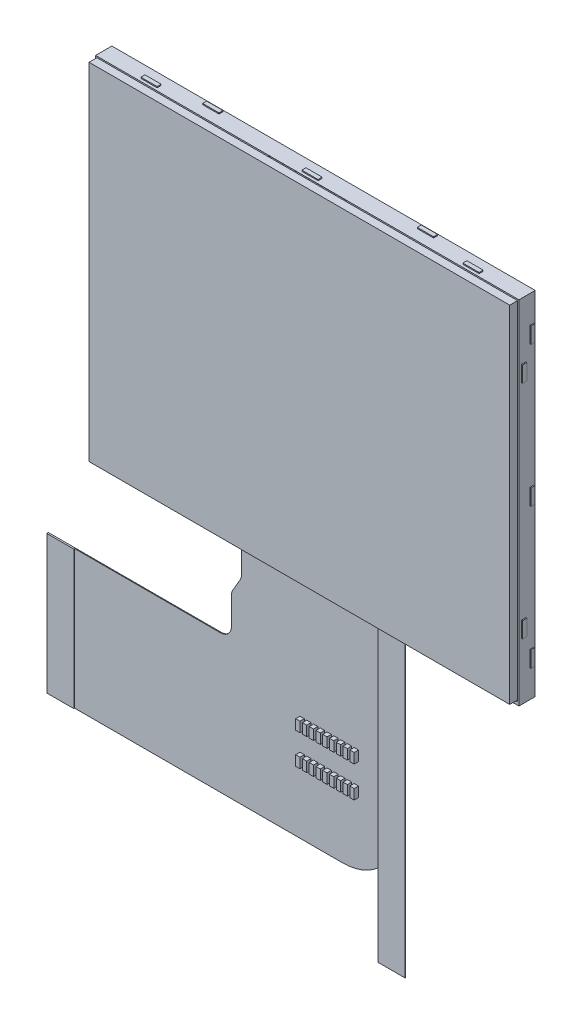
from build123d import *

# Parameters (mm, degrees)
SKETCH1_W             = 78.1
SKETCH1_H             = 64.9
SKETCH1_W_2           = 77.6
SKETCH1_H_2           = 63.8
SKETCH1_W_3           = 71.08
SKETCH1_H_3           = 53.56
SKETCH1_W_4           = 70.08
SKETCH1_H_4           = 52.56
MAIN_FRAME_DEPTH      = 3
SKETCH2_W             = 1.5
SKETCH2_H             = 15
CUT_EXTRUDE1_DEPTH    = 0.25
SKETCH3_W             = 28
SKETCH3_H             = 1.5
CUT_EXTRUDE2_DEPTH    = 0.55
SKETCH6_W             = 14.25
SKETCH6_H             = 0.5
CUT_EXTRUDE3_DEPTH    = 1.5
SKETCH4_W             = 0.75
SKETCH4_H             = 2.95
BOSS_EXTRUDE2_DEPTH   = 0.2
BOSS_EXTRUDE3_START   = -78.1
SKETCH4_2_W           = 0.75
SKETCH4_2_H           = 2.95
BOSS_EXTRUDE3_DEPTH   = 0.2
SKETCH5_W             = 3
SKETCH5_H             = 0.75
BOSS_EXTRUDE4_DEPTH   = 0.2
BOSS_EXTRUDE5_START   = -64.9
SKETCH5_2_W           = 3
SKETCH5_2_H           = 0.75
BOSS_EXTRUDE5_DEPTH   = 0.2
SKETCH7_W             = 77.6
SKETCH7_H             = 7.62
CUT_EXTRUDE4_DEPTH    = 0.5
FLEX_START            = 2
FLEX_TAIL_DEPTH       = 0.15
STIFFENER_START       = 2.15
SKETCH8_3_W           = 5
SKETCH8_3_H           = 25.5
STIFFENER_DEPTH       = 0.15
SKETCH9_W             = 3.5
SKETCH9_H             = 0.3
PINS_DEPTH            = 0.01
SKETCH10_W            = 0.8
SKETCH10_H            = 1.85
FPC_CAPS_DEPTH        = 0.8
SKETCH11_W            = 77.6
SKETCH11_H            = 63.8
RTP_DEPTH             = 1.45
SKETCH12_W            = 5
SKETCH12_H            = 54.4
RTP_FLEX_TAIL_DEPTH   = 0.1
SKETCH13_W            = 0.7
SKETCH13_H            = 3.5
BOSS_EXTRUDE8_DEPTH   = 0.1
BOSS_EXTRUDE8_2_DEPTH = 0.1
BOSS_EXTRUDE8_3_DEPTH = 0.1
BOSS_EXTRUDE8_4_DEPTH = 0.1


with BuildPart() as part:
    # Sketch1 → Main Frame (new body)
    # profile 1 of 4: a face of its own
    with BuildSketch(Plane.XY):
        Rectangle(SKETCH1_W, SKETCH1_H)
        Rectangle(SKETCH1_W_2, SKETCH1_H_2, mode=Mode.SUBTRACT)
    # profile 2 of 4: a face of its own
    with BuildSketch(Plane.XY):
        Rectangle(SKETCH1_W_2, SKETCH1_H_2)
        with Locations((0, 2.5)):
            Rectangle(SKETCH1_W_3, SKETCH1_H_3, mode=Mode.SUBTRACT)
    # profile 3 of 4: a face of its own
    with BuildSketch(Plane.XY):
        with Locations((0, 2.5)):
            Rectangle(SKETCH1_W_3, SKETCH1_H_3)
        with Locations((0.16, 2.4)):
            Rectangle(SKETCH1_W_4, SKETCH1_H_4, mode=Mode.SUBTRACT)
    # profile 4 of 4: a face of its own
    with BuildSketch(Plane.XY):
        with Locations((0.16, 2.4)):
            Rectangle(SKETCH1_W_4, SKETCH1_H_4)
    extrude(amount=MAIN_FRAME_DEPTH)

    # Sketch2 → Cut-Extrude1 (cut)
    with BuildSketch(Plane.ZY.offset(39.05)):
        with Locations((2.25, 2.85)):
            Rectangle(SKETCH2_W, SKETCH2_H)
    extrude(amount=-CUT_EXTRUDE1_DEPTH, mode=Mode.SUBTRACT)

    # Sketch3 → Cut-Extrude2 (cut)
    with BuildSketch(Plane.XZ.offset(32.45)):
        with Locations((0.4, 2.25)):
            Rectangle(SKETCH3_W, SKETCH3_H)
    extrude(amount=-CUT_EXTRUDE2_DEPTH, mode=Mode.SUBTRACT)

    # Sketch6 → Cut-Extrude3 (cut)
    with BuildSketch(Plane.XY.offset(3)):
        with Locations((0, 32.15)):
            Rectangle(SKETCH6_W, SKETCH6_H)
    extrude(amount=-CUT_EXTRUDE3_DEPTH, mode=Mode.SUBTRACT)

    # Sketch4 → Boss-Extrude2 (add)
    with BuildSketch(Plane(origin=(39.05, 0, 0), x_dir=(0, 0, -1), z_dir=(1, 0, 0))):
        with Locations((-0.625, -25.875)):
            Rectangle(SKETCH4_W, SKETCH4_H)
        with Locations((-2.125, -20.425)):
            Rectangle(SKETCH4_W, SKETCH4_H)
        with Locations((-0.625, 0)):
            Rectangle(SKETCH4_W, SKETCH4_H)
        with Locations((-2.125, 20.425)):
            Rectangle(SKETCH4_W, SKETCH4_H)
        with Locations((-0.625, 25.875)):
            Rectangle(SKETCH4_W, SKETCH4_H)
    extrude(amount=BOSS_EXTRUDE2_DEPTH)

    # Sketch4_2 → Boss-Extrude3 (add)
    with BuildSketch(Plane(origin=(39.05, 0, 0), x_dir=(0, 0, -1), z_dir=(1, 0, 0)).offset(BOSS_EXTRUDE3_START)):
        with Locations((-0.625, -25.875)):
            Rectangle(SKETCH4_2_W, SKETCH4_2_H)
        with Locations((-2.125, -20.425)):
            Rectangle(SKETCH4_2_W, SKETCH4_2_H)
        with Locations((-2.125, 20.425)):
            Rectangle(SKETCH4_2_W, SKETCH4_2_H)
        with Locations((-0.625, 25.875)):
            Rectangle(SKETCH4_2_W, SKETCH4_2_H)
    extrude(amount=-BOSS_EXTRUDE3_DEPTH)

    # Sketch5 → Boss-Extrude4 (add)
    with BuildSketch(Plane(origin=(0, 32.45, 0), x_dir=(1, 0, 0), z_dir=(0, 1, 0))):
        with Locations((29.7, -2.125)):
            Rectangle(SKETCH5_W, SKETCH5_H)
        with Locations((19.8, -0.625)):
            Rectangle(SKETCH5_W, SKETCH5_H)
        with Locations((0, -2.125)):
            Rectangle(SKETCH5_W, SKETCH5_H)
        with Locations((-19.8, -0.625)):
            Rectangle(SKETCH5_W, SKETCH5_H)
        with Locations((-29.7, -2.125)):
            Rectangle(SKETCH5_W, SKETCH5_H)
    extrude(amount=BOSS_EXTRUDE4_DEPTH)

    # Sketch5_2 → Boss-Extrude5 (add)
    with BuildSketch(Plane(origin=(0, 32.45, 0), x_dir=(1, 0, 0), z_dir=(0, 1, 0)).offset(BOSS_EXTRUDE5_START)):
        with Locations((29.7, -2.125)):
            Rectangle(SKETCH5_2_W, SKETCH5_2_H)
        with Locations((19.8, -0.625)):
            Rectangle(SKETCH5_2_W, SKETCH5_2_H)
        with Locations((-19.8, -0.625)):
            Rectangle(SKETCH5_2_W, SKETCH5_2_H)
        with Locations((-29.7, -2.125)):
            Rectangle(SKETCH5_2_W, SKETCH5_2_H)
    extrude(amount=-BOSS_EXTRUDE5_DEPTH)

    # Sketch7 → Cut-Extrude4 (cut)
    with BuildSketch(Plane.XY.offset(3)):
        with Locations((0, -28.09)):
            Rectangle(SKETCH7_W, SKETCH7_H)
    extrude(amount=-CUT_EXTRUDE4_DEPTH, mode=Mode.SUBTRACT)

    # Sketch8 → Flex Tail (add)
    with BuildSketch(Plane.XY.offset(FLEX_START)):
        with BuildLine():
            Line((13.775, -31.9), (-12.975, -31.9))
            Line((-12.975, -31.9), (-12.975, -37.860854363))
            ThreePointArc((-12.975, -37.860854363), (-13.043934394, -38.381417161), (-13.245985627, -38.866095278))
            Line((-13.245985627, -38.866095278), (-14.579014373, -41.158904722))
            ThreePointArc((-14.579014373, -41.158904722), (-14.781065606, -41.643582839), (-14.85, -42.164145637))
            Line((-14.85, -42.164145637), (-14.85, -47.125))
            ThreePointArc((-14.85, -47.125), (-15.435786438, -48.539213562), (-16.85, -49.125))
            Line((-16.85, -49.125), (-48.75, -49.125))
            Line((-48.75, -49.125), (-48.75, -74.625))
            Line((-48.75, -74.625), (5.65, -74.625))
            ThreePointArc((5.65, -74.625), (12.721067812, -71.696067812), (15.65, -64.625))
            Line((15.65, -64.625), (15.65, -42.164145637))
            ThreePointArc((15.65, -42.164145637), (15.581065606, -41.643582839), (15.379014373, -41.158904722))
            Line((15.379014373, -41.158904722), (14.045985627, -38.866095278))
            ThreePointArc((14.045985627, -38.866095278), (13.843934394, -38.381417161), (13.775, -37.860854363))
            Line((13.775, -37.860854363), (13.775, -31.9))
        make_face()
    extrude(amount=FLEX_TAIL_DEPTH)

    # Sketch8_3 → Stiffener (add)
    with BuildSketch(Plane.XY.offset(STIFFENER_START)):
        with Locations((-46.25, -61.875)):
            Rectangle(SKETCH8_3_W, SKETCH8_3_H)
    extrude(amount=STIFFENER_DEPTH)

    # Sketch9 → Pins (add)
    with BuildSketch(Plane(origin=(0, 0, 2), x_dir=(-1, 0, 0), z_dir=(0, 0, -1))):
        with Locations((47, -74.125)):
            Rectangle(SKETCH9_W, SKETCH9_H)
        with Locations((47, -73.625)):
            Rectangle(SKETCH9_W, SKETCH9_H)
        with Locations((47, -73.125)):
            Rectangle(SKETCH9_W, SKETCH9_H)
        with Locations((47, -72.625)):
            Rectangle(SKETCH9_W, SKETCH9_H)
        with Locations((47, -72.125)):
            Rectangle(SKETCH9_W, SKETCH9_H)
        with Locations((47, -71.625)):
            Rectangle(SKETCH9_W, SKETCH9_H)
        with Locations((47, -71.125)):
            Rectangle(SKETCH9_W, SKETCH9_H)
        with Locations((47, -70.625)):
            Rectangle(SKETCH9_W, SKETCH9_H)
        with Locations((47, -70.125)):
            Rectangle(SKETCH9_W, SKETCH9_H)
        with Locations((47, -69.625)):
            Rectangle(SKETCH9_W, SKETCH9_H)
        with Locations((47, -69.125)):
            Rectangle(SKETCH9_W, SKETCH9_H)
        with Locations((47, -68.625)):
            Rectangle(SKETCH9_W, SKETCH9_H)
        with Locations((47, -68.125)):
            Rectangle(SKETCH9_W, SKETCH9_H)
        with Locations((47, -67.625)):
            Rectangle(SKETCH9_W, SKETCH9_H)
        with Locations((47, -67.125)):
            Rectangle(SKETCH9_W, SKETCH9_H)
        with Locations((47, -66.625)):
            Rectangle(SKETCH9_W, SKETCH9_H)
        with Locations((47, -66.125)):
            Rectangle(SKETCH9_W, SKETCH9_H)
        with Locations((47, -65.625)):
            Rectangle(SKETCH9_W, SKETCH9_H)
        with Locations((47, -65.125)):
            Rectangle(SKETCH9_W, SKETCH9_H)
        with Locations((47, -64.625)):
            Rectangle(SKETCH9_W, SKETCH9_H)
        with Locations((47, -64.125)):
            Rectangle(SKETCH9_W, SKETCH9_H)
        with Locations((47, -63.625)):
            Rectangle(SKETCH9_W, SKETCH9_H)
        with Locations((47, -63.125)):
            Rectangle(SKETCH9_W, SKETCH9_H)
        with Locations((47, -62.625)):
            Rectangle(SKETCH9_W, SKETCH9_H)
        with Locations((47, -62.125)):
            Rectangle(SKETCH9_W, SKETCH9_H)
        with Locations((47, -61.625)):
            Rectangle(SKETCH9_W, SKETCH9_H)
        with Locations((47, -61.125)):
            Rectangle(SKETCH9_W, SKETCH9_H)
        with Locations((47, -60.625)):
            Rectangle(SKETCH9_W, SKETCH9_H)
        with Locations((47, -60.125)):
            Rectangle(SKETCH9_W, SKETCH9_H)
        with Locations((47, -59.625)):
            Rectangle(SKETCH9_W, SKETCH9_H)
        with Locations((47, -59.125)):
            Rectangle(SKETCH9_W, SKETCH9_H)
        with Locations((47, -58.625)):
            Rectangle(SKETCH9_W, SKETCH9_H)
        with Locations((47, -58.125)):
            Rectangle(SKETCH9_W, SKETCH9_H)
        with Locations((47, -57.625)):
            Rectangle(SKETCH9_W, SKETCH9_H)
        with Locations((47, -57.125)):
            Rectangle(SKETCH9_W, SKETCH9_H)
        with Locations((47, -56.625)):
            Rectangle(SKETCH9_W, SKETCH9_H)
        with Locations((47, -56.125)):
            Rectangle(SKETCH9_W, SKETCH9_H)
        with Locations((47, -55.625)):
            Rectangle(SKETCH9_W, SKETCH9_H)
        with Locations((47, -55.125)):
            Rectangle(SKETCH9_W, SKETCH9_H)
        with Locations((47, -54.625)):
            Rectangle(SKETCH9_W, SKETCH9_H)
        with Locations((47, -54.125)):
            Rectangle(SKETCH9_W, SKETCH9_H)
        with Locations((47, -53.625)):
            Rectangle(SKETCH9_W, SKETCH9_H)
        with Locations((47, -53.125)):
            Rectangle(SKETCH9_W, SKETCH9_H)
        with Locations((47, -52.625)):
            Rectangle(SKETCH9_W, SKETCH9_H)
        with Locations((47, -52.125)):
            Rectangle(SKETCH9_W, SKETCH9_H)
        with Locations((47, -51.625)):
            Rectangle(SKETCH9_W, SKETCH9_H)
        with Locations((47, -51.125)):
            Rectangle(SKETCH9_W, SKETCH9_H)
        with Locations((47, -50.625)):
            Rectangle(SKETCH9_W, SKETCH9_H)
        with Locations((47, -50.125)):
            Rectangle(SKETCH9_W, SKETCH9_H)
        with Locations((47, -49.625)):
            Rectangle(SKETCH9_W, SKETCH9_H)
    extrude(amount=PINS_DEPTH)

    # Sketch10 → FPC Caps (add)
    with BuildSketch(Plane.XY.offset(2.15)):
        with Locations((-1.8, -56.05)):
            Rectangle(SKETCH10_W, SKETCH10_H)
        with Locations((-0.55, -56.05)):
            Rectangle(SKETCH10_W, SKETCH10_H)
        with Locations((0.7, -56.05)):
            Rectangle(SKETCH10_W, SKETCH10_H)
        with Locations((1.95, -56.05)):
            Rectangle(SKETCH10_W, SKETCH10_H)
        with Locations((3.2, -56.05)):
            Rectangle(SKETCH10_W, SKETCH10_H)
        with Locations((4.45, -56.05)):
            Rectangle(SKETCH10_W, SKETCH10_H)
        with Locations((5.7, -56.05)):
            Rectangle(SKETCH10_W, SKETCH10_H)
        with Locations((6.95, -56.05)):
            Rectangle(SKETCH10_W, SKETCH10_H)
        with Locations((8.2, -56.05)):
            Rectangle(SKETCH10_W, SKETCH10_H)
        with Locations((-0.55, -61.8)):
            Rectangle(SKETCH10_W, SKETCH10_H)
        with Locations((0.7, -61.8)):
            Rectangle(SKETCH10_W, SKETCH10_H)
        with Locations((1.95, -61.8)):
            Rectangle(SKETCH10_W, SKETCH10_H)
        with Locations((3.2, -61.8)):
            Rectangle(SKETCH10_W, SKETCH10_H)
        with Locations((4.45, -61.8)):
            Rectangle(SKETCH10_W, SKETCH10_H)
        with Locations((5.7, -61.8)):
            Rectangle(SKETCH10_W, SKETCH10_H)
        with Locations((6.95, -61.8)):
            Rectangle(SKETCH10_W, SKETCH10_H)
        with Locations((8.2, -61.8)):
            Rectangle(SKETCH10_W, SKETCH10_H)
        with Locations((-1.8, -61.8)):
            Rectangle(SKETCH10_W, SKETCH10_H)
    extrude(amount=FPC_CAPS_DEPTH)


with BuildPart() as body_2:
    # Sketch11 → RTP (new body)
    with BuildSketch(Plane.XY.offset(3)):
        with Locations((0, 0.3)):
            Rectangle(SKETCH11_W, SKETCH11_H)
    extrude(amount=RTP_DEPTH)


with BuildPart() as body_3:
    # Sketch12 → RTP Flex Tail (new body)
    with BuildSketch(Plane.XY.offset(3)):
        with Locations((15.65, -59.1)):
            Rectangle(SKETCH12_W, SKETCH12_H)
    extrude(amount=RTP_FLEX_TAIL_DEPTH)


with BuildPart() as body_4:
    # Sketch13 → Boss-Extrude8 (new body)
    with BuildSketch(Plane(origin=(0, 0, 3), x_dir=(-1, 0, 0), z_dir=(0, 0, -1))):
        with Locations((-17.15, -84.55)):
            Rectangle(SKETCH13_W, SKETCH13_H)
    extrude(amount=BOSS_EXTRUDE8_DEPTH)


with BuildPart() as body_5:
    # Sketch13 → Boss-Extrude8 2 (new body)
    with BuildSketch(Plane(origin=(0, 0, 3), x_dir=(-1, 0, 0), z_dir=(0, 0, -1))):
        with Locations((-16.15, -84.55)):
            Rectangle(SKETCH13_W, SKETCH13_H)
    extrude(amount=BOSS_EXTRUDE8_2_DEPTH)


with BuildPart() as body_6:
    # Sketch13 → Boss-Extrude8 3 (new body)
    with BuildSketch(Plane(origin=(0, 0, 3), x_dir=(-1, 0, 0), z_dir=(0, 0, -1))):
        with Locations((-15.15, -84.55)):
            Rectangle(SKETCH13_W, SKETCH13_H)
    extrude(amount=BOSS_EXTRUDE8_3_DEPTH)


with BuildPart() as body_7:
    # Sketch13 → Boss-Extrude8 4 (new body)
    with BuildSketch(Plane(origin=(0, 0, 3), x_dir=(-1, 0, 0), z_dir=(0, 0, -1))):
        with Locations((-14.15, -84.55)):
            Rectangle(SKETCH13_W, SKETCH13_H)
    extrude(amount=BOSS_EXTRUDE8_4_DEPTH)


solid = Compound([part.part, body_2.part, body_3.part, body_4.part, body_5.part, body_6.part, body_7.part])
